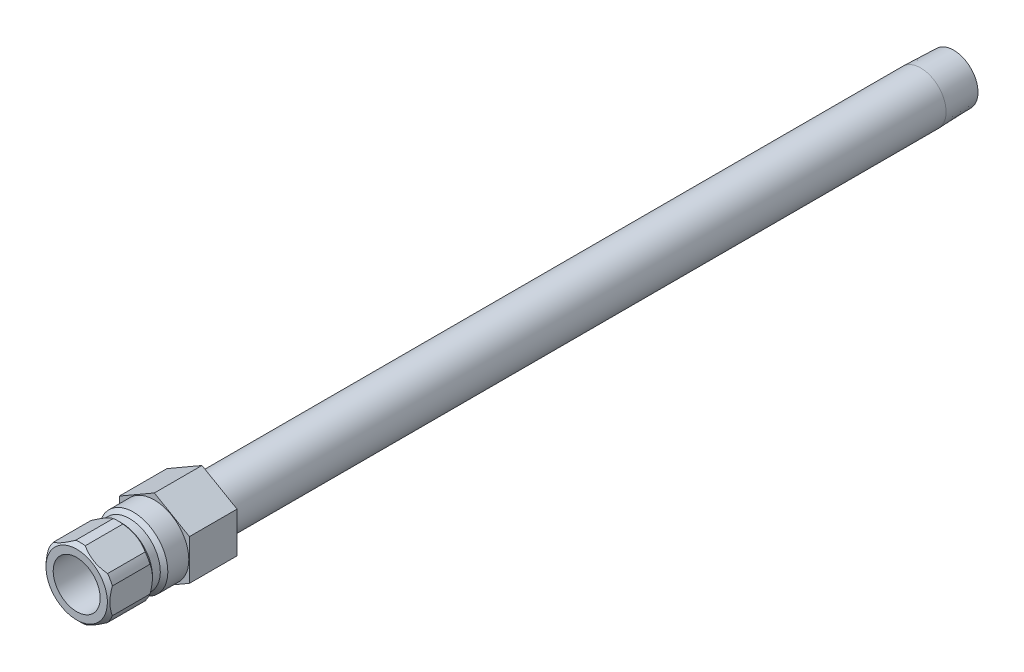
from build123d import *

# Parameters (mm, degrees)
SKETCH2_R           = 4.7625
BOSS_EXTRUDE1_DEPTH = 9.652
CUT_EXTRUDE1_START  = 6.604
SKETCH3_OUTSIDE_W   = 52.048
SKETCH3_OUTSIDE_H   = 54.248
CUT_EXTRUDE1_DEPTH  = 156.811738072


with BuildPart() as part:
    # Sketch1 → Revolve1 (revolve)
    with BuildSketch(Plane(origin=(0, 0, 0), x_dir=(0, 0, -1), z_dir=(1, 0, 0))):
        Polygon((-15.748, 4.7625), (-15.748, 6.223), (-14.986, 6.985), (-7.366, 6.985), (-6.604, 6.223), (-5.0165, 6.223), (-4.2545, 6.985), (9.652, 6.985), (9.652, 5.1435), (155.3718, 5.1435), (162.052, 4.934744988), (162.052, 3.4163), (-2.840212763, 3.4163), (-3.556, 4.7625), align=None)
    revolve(axis=Axis((0, 0, -9.652), (0, 0, 1)))

    # Sketch2 → Boss-Extrude1 (add)
    with BuildSketch(Plane.XY):
        Polygon((-7.112, 4.106115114), (-7.112, -4.106115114), (0, -8.212230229), (7.112, -4.106115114), (7.112, 4.106115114), (0, 8.212230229), align=None)
        with Locations(Location((0, 0, 0), (0, 0, 90))):
            Circle(SKETCH2_R, mode=Mode.SUBTRACT)
    extrude(amount=-BOSS_EXTRUDE1_DEPTH)

    # Sketch3 outside → Cut-Extrude1 (cut, through all)
    with BuildSketch(Plane.XY.offset(CUT_EXTRUDE1_START)):
        Rectangle(SKETCH3_OUTSIDE_W, SKETCH3_OUTSIDE_H)
        Polygon((6.477, 3.739497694), (0, 7.478995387), (-6.477, 3.739497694), (-6.477, -3.739497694), (0, -7.478995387), (6.477, -3.739497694), align=None, mode=Mode.SUBTRACT)
    extrude(amount=CUT_EXTRUDE1_DEPTH, mode=Mode.SUBTRACT)


solid = part.part
